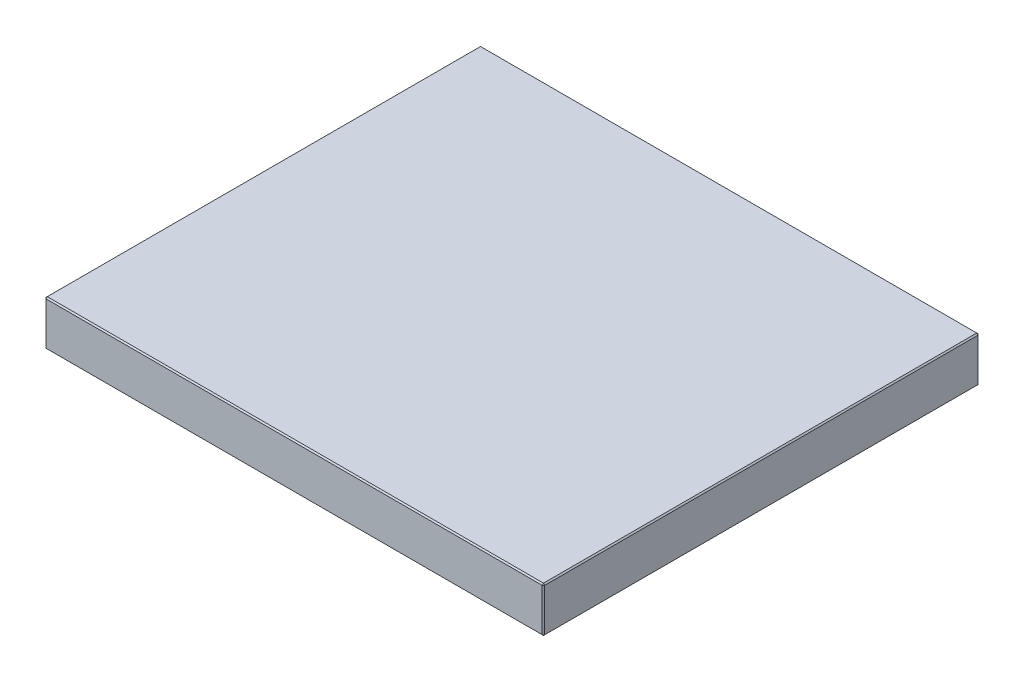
ISO-10303-21;
HEADER;
FILE_DESCRIPTION(('STEP AP214'),'2;1');
FILE_NAME('part.step','',(''),(''),'','','');
FILE_SCHEMA(('AUTOMOTIVE_DESIGN { 1 0 10303 214 1 1 1 1 }'));
ENDSEC;
DATA;
#1=APPLICATION_CONTEXT('core data for automotive mechanical design processes');
#2=APPLICATION_PROTOCOL_DEFINITION('international standard','automotive_design',2000,#1);
#3=PRODUCT_CONTEXT('',#1,'mechanical');
#4=PRODUCT('Part','Part','',(#3));
#5=PRODUCT_RELATED_PRODUCT_CATEGORY('part','',(#4));
#6=PRODUCT_DEFINITION_FORMATION('','',#4);
#7=PRODUCT_DEFINITION_CONTEXT('part definition',#1,'design');
#8=PRODUCT_DEFINITION('design','',#6,#7);
#9=PRODUCT_DEFINITION_SHAPE('','',#8);
#10=(LENGTH_UNIT() NAMED_UNIT(*) SI_UNIT(.MILLI.,.METRE.));
#11=(NAMED_UNIT(*) PLANE_ANGLE_UNIT() SI_UNIT($,.RADIAN.));
#12=(NAMED_UNIT(*) SI_UNIT($,.STERADIAN.) SOLID_ANGLE_UNIT());
#13=UNCERTAINTY_MEASURE_WITH_UNIT(LENGTH_MEASURE(1.E-05),#10,'distance_accuracy_value','');
#14=(GEOMETRIC_REPRESENTATION_CONTEXT(3) GLOBAL_UNCERTAINTY_ASSIGNED_CONTEXT((#13)) GLOBAL_UNIT_ASSIGNED_CONTEXT((#10,
#11,#12)) REPRESENTATION_CONTEXT('',''));
#15=CARTESIAN_POINT('',(0.,0.,0.));
#16=DIRECTION('',(0.,0.,1.));
#17=DIRECTION('',(1.,0.,0.));
#18=AXIS2_PLACEMENT_3D('',#15,#16,#17);
#19=CARTESIAN_POINT('',(-198.,36.,173.));
#20=DIRECTION('',(1.,0.,0.));
#21=DIRECTION('',(0.,0.,-1.));
#22=AXIS2_PLACEMENT_3D('',#19,#20,#21);
#23=PLANE('',#22);
#24=DIRECTION('',(0.,-1.,0.));
#25=VECTOR('',#24,1.);
#26=CARTESIAN_POINT('',(-198.,36.,-172.));
#27=LINE('',#26,#25);
#28=CARTESIAN_POINT('',(-198.,35.,-172.));
#29=VERTEX_POINT('',#28);
#30=CARTESIAN_POINT('',(-198.,1.,-172.));
#31=VERTEX_POINT('',#30);
#32=EDGE_CURVE('E115',#29,#31,#27,.T.);
#33=ORIENTED_EDGE('',*,*,#32,.T.);
#34=DIRECTION('',(0.,0.,1.));
#35=VECTOR('',#34,1.);
#36=CARTESIAN_POINT('',(-198.,1.,173.));
#37=LINE('',#36,#35);
#38=CARTESIAN_POINT('',(-198.,1.,172.));
#39=VERTEX_POINT('',#38);
#40=EDGE_CURVE('E111',#31,#39,#37,.T.);
#41=ORIENTED_EDGE('',*,*,#40,.T.);
#42=DIRECTION('',(0.,1.,0.));
#43=VECTOR('',#42,1.);
#44=CARTESIAN_POINT('',(-198.,36.,172.));
#45=LINE('',#44,#43);
#46=CARTESIAN_POINT('',(-198.,35.,172.));
#47=VERTEX_POINT('',#46);
#48=EDGE_CURVE('E104',#39,#47,#45,.T.);
#49=ORIENTED_EDGE('',*,*,#48,.T.);
#50=DIRECTION('',(0.,0.,-1.));
#51=VECTOR('',#50,1.);
#52=CARTESIAN_POINT('',(-198.,35.,-173.));
#53=LINE('',#52,#51);
#54=EDGE_CURVE('E108',#47,#29,#53,.T.);
#55=ORIENTED_EDGE('',*,*,#54,.T.);
#56=EDGE_LOOP('',(#33,#41,#49,#55));
#57=FACE_BOUND('',#56,.T.);
#58=ADVANCED_FACE('F16',(#57),#23,.F.);
#59=CARTESIAN_POINT('',(198.,36.,173.));
#60=DIRECTION('',(0.,0.,-1.));
#61=DIRECTION('',(-1.,0.,0.));
#62=AXIS2_PLACEMENT_3D('',#59,#60,#61);
#63=PLANE('',#62);
#64=DIRECTION('',(-1.,0.,0.));
#65=VECTOR('',#64,1.);
#66=CARTESIAN_POINT('',(-198.,35.,173.));
#67=LINE('',#66,#65);
#68=CARTESIAN_POINT('',(197.,35.,173.));
#69=VERTEX_POINT('',#68);
#70=CARTESIAN_POINT('',(-197.,35.,173.));
#71=VERTEX_POINT('',#70);
#72=EDGE_CURVE('E165',#69,#71,#67,.T.);
#73=ORIENTED_EDGE('',*,*,#72,.T.);
#74=DIRECTION('',(0.,-1.,0.));
#75=VECTOR('',#74,1.);
#76=CARTESIAN_POINT('',(-197.,36.,173.));
#77=LINE('',#76,#75);
#78=CARTESIAN_POINT('',(-197.,1.00000000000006,173.));
#79=VERTEX_POINT('',#78);
#80=EDGE_CURVE('E123',#71,#79,#77,.T.);
#81=ORIENTED_EDGE('',*,*,#80,.T.);
#82=DIRECTION('',(1.,0.,0.));
#83=VECTOR('',#82,1.);
#84=CARTESIAN_POINT('',(198.,1.00000000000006,173.));
#85=LINE('',#84,#83);
#86=CARTESIAN_POINT('',(197.,1.00000000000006,173.));
#87=VERTEX_POINT('',#86);
#88=EDGE_CURVE('E169',#79,#87,#85,.T.);
#89=ORIENTED_EDGE('',*,*,#88,.T.);
#90=DIRECTION('',(0.,1.,0.));
#91=VECTOR('',#90,1.);
#92=CARTESIAN_POINT('',(197.,36.,173.));
#93=LINE('',#92,#91);
#94=EDGE_CURVE('E167',#87,#69,#93,.T.);
#95=ORIENTED_EDGE('',*,*,#94,.T.);
#96=EDGE_LOOP('',(#73,#81,#89,#95));
#97=FACE_BOUND('',#96,.T.);
#98=ADVANCED_FACE('F276',(#97),#63,.F.);
#99=CARTESIAN_POINT('',(198.,36.,173.));
#100=DIRECTION('',(-1.,0.,0.));
#101=DIRECTION('',(0.,0.,1.));
#102=AXIS2_PLACEMENT_3D('',#99,#100,#101);
#103=PLANE('',#102);
#104=DIRECTION('',(0.,0.,-1.));
#105=VECTOR('',#104,1.);
#106=CARTESIAN_POINT('',(198.,1.00000000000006,173.));
#107=LINE('',#106,#105);
#108=CARTESIAN_POINT('',(198.,1.00000000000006,172.));
#109=VERTEX_POINT('',#108);
#110=CARTESIAN_POINT('',(198.,1.00000000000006,-172.));
#111=VERTEX_POINT('',#110);
#112=EDGE_CURVE('E160',#109,#111,#107,.T.);
#113=ORIENTED_EDGE('',*,*,#112,.T.);
#114=DIRECTION('',(0.,1.,0.));
#115=VECTOR('',#114,1.);
#116=CARTESIAN_POINT('',(198.,36.,-172.));
#117=LINE('',#116,#115);
#118=CARTESIAN_POINT('',(198.,35.,-172.));
#119=VERTEX_POINT('',#118);
#120=EDGE_CURVE('E162',#111,#119,#117,.T.);
#121=ORIENTED_EDGE('',*,*,#120,.T.);
#122=DIRECTION('',(0.,0.,1.));
#123=VECTOR('',#122,1.);
#124=CARTESIAN_POINT('',(198.,35.,173.));
#125=LINE('',#124,#123);
#126=CARTESIAN_POINT('',(198.,35.,172.));
#127=VERTEX_POINT('',#126);
#128=EDGE_CURVE('E156',#119,#127,#125,.T.);
#129=ORIENTED_EDGE('',*,*,#128,.T.);
#130=DIRECTION('',(0.,-1.,0.));
#131=VECTOR('',#130,1.);
#132=CARTESIAN_POINT('',(198.,36.,172.));
#133=LINE('',#132,#131);
#134=EDGE_CURVE('E158',#127,#109,#133,.T.);
#135=ORIENTED_EDGE('',*,*,#134,.T.);
#136=EDGE_LOOP('',(#113,#121,#129,#135));
#137=FACE_BOUND('',#136,.T.);
#138=ADVANCED_FACE('F255',(#137),#103,.F.);
#139=CARTESIAN_POINT('',(198.,36.,-173.));
#140=DIRECTION('',(0.,0.,1.));
#141=DIRECTION('',(1.,0.,0.));
#142=AXIS2_PLACEMENT_3D('',#139,#140,#141);
#143=PLANE('',#142);
#144=DIRECTION('',(0.,-1.,0.));
#145=VECTOR('',#144,1.);
#146=CARTESIAN_POINT('',(197.,36.,-173.));
#147=LINE('',#146,#145);
#148=CARTESIAN_POINT('',(197.,35.,-173.));
#149=VERTEX_POINT('',#148);
#150=CARTESIAN_POINT('',(197.,1.00000000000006,-173.));
#151=VERTEX_POINT('',#150);
#152=EDGE_CURVE('E149',#149,#151,#147,.T.);
#153=ORIENTED_EDGE('',*,*,#152,.T.);
#154=DIRECTION('',(-1.,0.,0.));
#155=VECTOR('',#154,1.);
#156=CARTESIAN_POINT('',(198.,1.00000000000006,-173.));
#157=LINE('',#156,#155);
#158=CARTESIAN_POINT('',(-197.,1.00000000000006,-173.));
#159=VERTEX_POINT('',#158);
#160=EDGE_CURVE('E154',#151,#159,#157,.T.);
#161=ORIENTED_EDGE('',*,*,#160,.T.);
#162=DIRECTION('',(0.,1.,0.));
#163=VECTOR('',#162,1.);
#164=CARTESIAN_POINT('',(-197.,36.,-173.));
#165=LINE('',#164,#163);
#166=CARTESIAN_POINT('',(-197.,35.,-173.));
#167=VERTEX_POINT('',#166);
#168=EDGE_CURVE('E151',#159,#167,#165,.T.);
#169=ORIENTED_EDGE('',*,*,#168,.T.);
#170=DIRECTION('',(1.,0.,0.));
#171=VECTOR('',#170,1.);
#172=CARTESIAN_POINT('',(198.,35.,-173.));
#173=LINE('',#172,#171);
#174=EDGE_CURVE('E147',#167,#149,#173,.T.);
#175=ORIENTED_EDGE('',*,*,#174,.T.);
#176=EDGE_LOOP('',(#153,#161,#169,#175));
#177=FACE_BOUND('',#176,.T.);
#178=ADVANCED_FACE('F285',(#177),#143,.F.);
#179=CARTESIAN_POINT('',(0.,36.,0.));
#180=DIRECTION('',(0.,1.,0.));
#181=DIRECTION('',(0.,0.,1.));
#182=AXIS2_PLACEMENT_3D('',#179,#180,#181);
#183=PLANE('',#182);
#184=DIRECTION('',(0.,0.,-1.));
#185=VECTOR('',#184,1.);
#186=CARTESIAN_POINT('',(197.,36.,-173.));
#187=LINE('',#186,#185);
#188=CARTESIAN_POINT('',(197.,36.,172.));
#189=VERTEX_POINT('',#188);
#190=CARTESIAN_POINT('',(197.,36.,-172.));
#191=VERTEX_POINT('',#190);
#192=EDGE_CURVE('E25',#189,#191,#187,.T.);
#193=ORIENTED_EDGE('',*,*,#192,.T.);
#194=DIRECTION('',(-1.,0.,0.));
#195=VECTOR('',#194,1.);
#196=CARTESIAN_POINT('',(-198.,36.,-172.));
#197=LINE('',#196,#195);
#198=CARTESIAN_POINT('',(-197.,36.,-172.));
#199=VERTEX_POINT('',#198);
#200=EDGE_CURVE('E10',#191,#199,#197,.T.);
#201=ORIENTED_EDGE('',*,*,#200,.T.);
#202=DIRECTION('',(0.,0.,1.));
#203=VECTOR('',#202,1.);
#204=CARTESIAN_POINT('',(-197.,36.,173.));
#205=LINE('',#204,#203);
#206=CARTESIAN_POINT('',(-197.,36.,172.));
#207=VERTEX_POINT('',#206);
#208=EDGE_CURVE('E181',#199,#207,#205,.T.);
#209=ORIENTED_EDGE('',*,*,#208,.T.);
#210=DIRECTION('',(1.,0.,0.));
#211=VECTOR('',#210,1.);
#212=CARTESIAN_POINT('',(198.,36.,172.));
#213=LINE('',#212,#211);
#214=EDGE_CURVE('E36',#207,#189,#213,.T.);
#215=ORIENTED_EDGE('',*,*,#214,.T.);
#216=EDGE_LOOP('',(#193,#201,#209,#215));
#217=FACE_BOUND('',#216,.T.);
#218=ADVANCED_FACE('F351',(#217),#183,.T.);
#219=CARTESIAN_POINT('',(0.,0.,0.));
#220=DIRECTION('',(0.,1.,0.));
#221=DIRECTION('',(0.,0.,1.));
#222=AXIS2_PLACEMENT_3D('',#219,#220,#221);
#223=PLANE('',#222);
#224=DIRECTION('',(0.,0.,1.));
#225=VECTOR('',#224,1.);
#226=CARTESIAN_POINT('',(197.,0.,0.));
#227=LINE('',#226,#225);
#228=CARTESIAN_POINT('',(197.,0.,-172.));
#229=VERTEX_POINT('',#228);
#230=CARTESIAN_POINT('',(197.,0.,172.));
#231=VERTEX_POINT('',#230);
#232=EDGE_CURVE('E172',#229,#231,#227,.T.);
#233=ORIENTED_EDGE('',*,*,#232,.T.);
#234=DIRECTION('',(-1.,0.,0.));
#235=VECTOR('',#234,1.);
#236=CARTESIAN_POINT('',(0.,0.,172.));
#237=LINE('',#236,#235);
#238=CARTESIAN_POINT('',(-197.,0.,172.));
#239=VERTEX_POINT('',#238);
#240=EDGE_CURVE('E178',#231,#239,#237,.T.);
#241=ORIENTED_EDGE('',*,*,#240,.T.);
#242=DIRECTION('',(0.,0.,-1.));
#243=VECTOR('',#242,1.);
#244=CARTESIAN_POINT('',(-197.,0.,0.));
#245=LINE('',#244,#243);
#246=CARTESIAN_POINT('',(-197.,0.,-172.));
#247=VERTEX_POINT('',#246);
#248=EDGE_CURVE('E176',#239,#247,#245,.T.);
#249=ORIENTED_EDGE('',*,*,#248,.T.);
#250=DIRECTION('',(1.,0.,0.));
#251=VECTOR('',#250,1.);
#252=CARTESIAN_POINT('',(0.,0.,-172.));
#253=LINE('',#252,#251);
#254=EDGE_CURVE('E174',#247,#229,#253,.T.);
#255=ORIENTED_EDGE('',*,*,#254,.T.);
#256=EDGE_LOOP('',(#233,#241,#249,#255));
#257=FACE_BOUND('',#256,.T.);
#258=ADVANCED_FACE('F247',(#257),#223,.F.);
#259=CARTESIAN_POINT('',(198.,36.,172.));
#260=DIRECTION('',(-0.707106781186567,0.,-0.707106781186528));
#261=DIRECTION('',(0.,-1.,0.));
#262=AXIS2_PLACEMENT_3D('',#259,#260,#261);
#263=PLANE('',#262);
#264=DIRECTION('',(-0.707106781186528,0.,0.707106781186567));
#265=VECTOR('',#264,1.);
#266=CARTESIAN_POINT('',(197.,35.,173.));
#267=LINE('',#266,#265);
#268=EDGE_CURVE('E20',#69,#127,#267,.F.);
#269=ORIENTED_EDGE('',*,*,#268,.F.);
#270=ORIENTED_EDGE('',*,*,#94,.F.);
#271=DIRECTION('',(0.707106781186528,0.,-0.707106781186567));
#272=VECTOR('',#271,1.);
#273=CARTESIAN_POINT('',(197.,1.00000000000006,173.));
#274=LINE('',#273,#272);
#275=EDGE_CURVE('E143',#109,#87,#274,.F.);
#276=ORIENTED_EDGE('',*,*,#275,.F.);
#277=ORIENTED_EDGE('',*,*,#134,.F.);
#278=EDGE_LOOP('',(#269,#270,#276,#277));
#279=FACE_BOUND('',#278,.T.);
#280=ADVANCED_FACE('F18',(#279),#263,.F.);
#281=CARTESIAN_POINT('',(197.,35.,173.));
#282=DIRECTION('',(0.577350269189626,0.577350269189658,0.577350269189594));
#283=DIRECTION('',(-0.707106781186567,0.707106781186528,0.));
#284=AXIS2_PLACEMENT_3D('',#281,#282,#283);
#285=PLANE('',#284);
#286=DIRECTION('',(0.,-0.707106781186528,0.707106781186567));
#287=VECTOR('',#286,1.);
#288=CARTESIAN_POINT('',(197.,35.,173.));
#289=LINE('',#288,#287);
#290=EDGE_CURVE('E227',#69,#189,#289,.F.);
#291=ORIENTED_EDGE('',*,*,#290,.F.);
#292=ORIENTED_EDGE('',*,*,#268,.T.);
#293=DIRECTION('',(-0.707106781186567,0.707106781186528,0.));
#294=VECTOR('',#293,1.);
#295=CARTESIAN_POINT('',(197.5,35.5,172.));
#296=LINE('',#295,#294);
#297=EDGE_CURVE('E229',#189,#127,#296,.F.);
#298=ORIENTED_EDGE('',*,*,#297,.F.);
#299=EDGE_LOOP('',(#291,#292,#298));
#300=FACE_BOUND('',#299,.T.);
#301=ADVANCED_FACE('F271',(#300),#285,.T.);
#302=CARTESIAN_POINT('',(197.,1.00000000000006,173.));
#303=DIRECTION('',(0.577350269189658,-0.577350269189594,0.577350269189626));
#304=DIRECTION('',(0.707106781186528,0.,-0.707106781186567));
#305=AXIS2_PLACEMENT_3D('',#302,#303,#304);
#306=PLANE('',#305);
#307=DIRECTION('',(-0.707106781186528,-0.707106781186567,0.));
#308=VECTOR('',#307,1.);
#309=CARTESIAN_POINT('',(197.5,0.500000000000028,172.));
#310=LINE('',#309,#308);
#311=EDGE_CURVE('E221',#109,#231,#310,.T.);
#312=ORIENTED_EDGE('',*,*,#311,.F.);
#313=ORIENTED_EDGE('',*,*,#275,.T.);
#314=DIRECTION('',(0.,0.707106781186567,0.707106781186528));
#315=VECTOR('',#314,1.);
#316=CARTESIAN_POINT('',(197.,1.00000000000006,173.));
#317=LINE('',#316,#315);
#318=EDGE_CURVE('E224',#231,#87,#317,.T.);
#319=ORIENTED_EDGE('',*,*,#318,.F.);
#320=EDGE_LOOP('',(#312,#313,#319));
#321=FACE_BOUND('',#320,.T.);
#322=ADVANCED_FACE('F236',(#321),#306,.T.);
#323=CARTESIAN_POINT('',(197.,36.,0.));
#324=DIRECTION('',(0.707106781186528,0.707106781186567,0.));
#325=DIRECTION('',(0.,0.,1.));
#326=AXIS2_PLACEMENT_3D('',#323,#324,#325);
#327=PLANE('',#326);
#328=ORIENTED_EDGE('',*,*,#297,.T.);
#329=ORIENTED_EDGE('',*,*,#128,.F.);
#330=DIRECTION('',(0.707106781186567,-0.707106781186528,0.));
#331=VECTOR('',#330,1.);
#332=CARTESIAN_POINT('',(198.,35.,-172.));
#333=LINE('',#332,#331);
#334=EDGE_CURVE('E216',#191,#119,#333,.T.);
#335=ORIENTED_EDGE('',*,*,#334,.F.);
#336=ORIENTED_EDGE('',*,*,#192,.F.);
#337=EDGE_LOOP('',(#328,#329,#335,#336));
#338=FACE_BOUND('',#337,.T.);
#339=ADVANCED_FACE('F266',(#338),#327,.T.);
#340=CARTESIAN_POINT('',(0.,36.,172.));
#341=DIRECTION('',(0.,0.707106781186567,0.707106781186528));
#342=DIRECTION('',(-1.,0.,0.));
#343=AXIS2_PLACEMENT_3D('',#340,#341,#342);
#344=PLANE('',#343);
#345=ORIENTED_EDGE('',*,*,#290,.T.);
#346=ORIENTED_EDGE('',*,*,#214,.F.);
#347=DIRECTION('',(0.,0.707106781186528,-0.707106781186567));
#348=VECTOR('',#347,1.);
#349=CARTESIAN_POINT('',(-197.,35.5,172.5));
#350=LINE('',#349,#348);
#351=EDGE_CURVE('E127',#71,#207,#350,.T.);
#352=ORIENTED_EDGE('',*,*,#351,.F.);
#353=ORIENTED_EDGE('',*,*,#72,.F.);
#354=EDGE_LOOP('',(#345,#346,#352,#353));
#355=FACE_BOUND('',#354,.T.);
#356=ADVANCED_FACE('F274',(#355),#344,.T.);
#357=CARTESIAN_POINT('',(-197.,36.,173.));
#358=DIRECTION('',(0.707106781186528,0.,-0.707106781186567));
#359=DIRECTION('',(0.,-1.,0.));
#360=AXIS2_PLACEMENT_3D('',#357,#358,#359);
#361=PLANE('',#360);
#362=DIRECTION('',(0.707106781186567,0.,0.707106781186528));
#363=VECTOR('',#362,1.);
#364=CARTESIAN_POINT('',(-197.,1.00000000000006,173.));
#365=LINE('',#364,#363);
#366=EDGE_CURVE('E128',#79,#39,#365,.F.);
#367=ORIENTED_EDGE('',*,*,#366,.F.);
#368=ORIENTED_EDGE('',*,*,#80,.F.);
#369=DIRECTION('',(-0.707106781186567,0.,-0.707106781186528));
#370=VECTOR('',#369,1.);
#371=CARTESIAN_POINT('',(-198.,35.,172.));
#372=LINE('',#371,#370);
#373=EDGE_CURVE('E119',#47,#71,#372,.F.);
#374=ORIENTED_EDGE('',*,*,#373,.F.);
#375=ORIENTED_EDGE('',*,*,#48,.F.);
#376=EDGE_LOOP('',(#367,#368,#374,#375));
#377=FACE_BOUND('',#376,.T.);
#378=ADVANCED_FACE('F121',(#377),#361,.F.);
#379=CARTESIAN_POINT('',(198.,1.00000000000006,173.));
#380=DIRECTION('',(0.,0.707106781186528,-0.707106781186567));
#381=DIRECTION('',(1.,0.,0.));
#382=AXIS2_PLACEMENT_3D('',#379,#380,#381);
#383=PLANE('',#382);
#384=ORIENTED_EDGE('',*,*,#318,.T.);
#385=ORIENTED_EDGE('',*,*,#88,.F.);
#386=DIRECTION('',(0.,-0.707106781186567,-0.707106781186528));
#387=VECTOR('',#386,1.);
#388=CARTESIAN_POINT('',(-197.,1.00000000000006,173.));
#389=LINE('',#388,#387);
#390=EDGE_CURVE('E212',#239,#79,#389,.F.);
#391=ORIENTED_EDGE('',*,*,#390,.F.);
#392=ORIENTED_EDGE('',*,*,#240,.F.);
#393=EDGE_LOOP('',(#384,#385,#391,#392));
#394=FACE_BOUND('',#393,.T.);
#395=ADVANCED_FACE('F244',(#394),#383,.F.);
#396=CARTESIAN_POINT('',(198.,1.00000000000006,173.));
#397=DIRECTION('',(-0.707106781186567,0.707106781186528,0.));
#398=DIRECTION('',(0.,0.,-1.));
#399=AXIS2_PLACEMENT_3D('',#396,#397,#398);
#400=PLANE('',#399);
#401=ORIENTED_EDGE('',*,*,#311,.T.);
#402=ORIENTED_EDGE('',*,*,#232,.F.);
#403=DIRECTION('',(0.707106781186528,0.707106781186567,0.));
#404=VECTOR('',#403,1.);
#405=CARTESIAN_POINT('',(197.5,0.500000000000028,-172.));
#406=LINE('',#405,#404);
#407=EDGE_CURVE('E209',#111,#229,#406,.F.);
#408=ORIENTED_EDGE('',*,*,#407,.F.);
#409=ORIENTED_EDGE('',*,*,#112,.F.);
#410=EDGE_LOOP('',(#401,#402,#408,#409));
#411=FACE_BOUND('',#410,.T.);
#412=ADVANCED_FACE('F252',(#411),#400,.F.);
#413=CARTESIAN_POINT('',(197.,36.,-173.));
#414=DIRECTION('',(-0.707106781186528,0.,0.707106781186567));
#415=DIRECTION('',(0.,-1.,0.));
#416=AXIS2_PLACEMENT_3D('',#413,#414,#415);
#417=PLANE('',#416);
#418=DIRECTION('',(0.707106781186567,0.,0.707106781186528));
#419=VECTOR('',#418,1.);
#420=CARTESIAN_POINT('',(198.,35.,-172.));
#421=LINE('',#420,#419);
#422=EDGE_CURVE('E218',#119,#149,#421,.F.);
#423=ORIENTED_EDGE('',*,*,#422,.F.);
#424=ORIENTED_EDGE('',*,*,#120,.F.);
#425=DIRECTION('',(-0.707106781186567,0.,-0.707106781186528));
#426=VECTOR('',#425,1.);
#427=CARTESIAN_POINT('',(197.,1.00000000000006,-173.));
#428=LINE('',#427,#426);
#429=EDGE_CURVE('E206',#151,#111,#428,.F.);
#430=ORIENTED_EDGE('',*,*,#429,.F.);
#431=ORIENTED_EDGE('',*,*,#152,.F.);
#432=EDGE_LOOP('',(#423,#424,#430,#431));
#433=FACE_BOUND('',#432,.T.);
#434=ADVANCED_FACE('F259',(#433),#417,.F.);
#435=CARTESIAN_POINT('',(198.,35.,-172.));
#436=DIRECTION('',(0.577350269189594,0.577350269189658,-0.577350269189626));
#437=DIRECTION('',(0.,0.707106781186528,0.707106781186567));
#438=AXIS2_PLACEMENT_3D('',#435,#436,#437);
#439=PLANE('',#438);
#440=ORIENTED_EDGE('',*,*,#334,.T.);
#441=ORIENTED_EDGE('',*,*,#422,.T.);
#442=DIRECTION('',(0.,0.707106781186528,0.707106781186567));
#443=VECTOR('',#442,1.);
#444=CARTESIAN_POINT('',(197.,35.5,-172.5));
#445=LINE('',#444,#443);
#446=EDGE_CURVE('E135',#191,#149,#445,.F.);
#447=ORIENTED_EDGE('',*,*,#446,.F.);
#448=EDGE_LOOP('',(#440,#441,#447));
#449=FACE_BOUND('',#448,.T.);
#450=ADVANCED_FACE('F326',(#449),#439,.T.);
#451=CARTESIAN_POINT('',(-198.,35.,172.));
#452=DIRECTION('',(-0.577350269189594,0.577350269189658,0.577350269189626));
#453=DIRECTION('',(0.,-0.707106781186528,0.707106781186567));
#454=AXIS2_PLACEMENT_3D('',#451,#452,#453);
#455=PLANE('',#454);
#456=ORIENTED_EDGE('',*,*,#373,.T.);
#457=ORIENTED_EDGE('',*,*,#351,.T.);
#458=DIRECTION('',(-0.707106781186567,-0.707106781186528,0.));
#459=VECTOR('',#458,1.);
#460=CARTESIAN_POINT('',(-198.,35.,172.));
#461=LINE('',#460,#459);
#462=EDGE_CURVE('E131',#47,#207,#461,.F.);
#463=ORIENTED_EDGE('',*,*,#462,.F.);
#464=EDGE_LOOP('',(#456,#457,#463));
#465=FACE_BOUND('',#464,.T.);
#466=ADVANCED_FACE('F132',(#465),#455,.T.);
#467=CARTESIAN_POINT('',(-197.,1.00000000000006,173.));
#468=DIRECTION('',(-0.577350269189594,-0.577350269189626,0.577350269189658));
#469=DIRECTION('',(0.,-0.707106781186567,-0.707106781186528));
#470=AXIS2_PLACEMENT_3D('',#467,#468,#469);
#471=PLANE('',#470);
#472=ORIENTED_EDGE('',*,*,#390,.T.);
#473=ORIENTED_EDGE('',*,*,#366,.T.);
#474=DIRECTION('',(-0.707106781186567,0.707106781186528,0.));
#475=VECTOR('',#474,1.);
#476=CARTESIAN_POINT('',(-197.5,0.5,172.));
#477=LINE('',#476,#475);
#478=EDGE_CURVE('E136',#239,#39,#477,.T.);
#479=ORIENTED_EDGE('',*,*,#478,.F.);
#480=EDGE_LOOP('',(#472,#473,#479));
#481=FACE_BOUND('',#480,.T.);
#482=ADVANCED_FACE('F319',(#481),#471,.T.);
#483=CARTESIAN_POINT('',(197.,1.00000000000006,-173.));
#484=DIRECTION('',(0.577350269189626,-0.577350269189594,-0.577350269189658));
#485=DIRECTION('',(-0.707106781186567,0.,-0.707106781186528));
#486=AXIS2_PLACEMENT_3D('',#483,#484,#485);
#487=PLANE('',#486);
#488=ORIENTED_EDGE('',*,*,#429,.T.);
#489=ORIENTED_EDGE('',*,*,#407,.T.);
#490=DIRECTION('',(0.,-0.707106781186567,0.707106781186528));
#491=VECTOR('',#490,1.);
#492=CARTESIAN_POINT('',(197.,1.00000000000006,-173.));
#493=LINE('',#492,#491);
#494=EDGE_CURVE('E199',#151,#229,#493,.T.);
#495=ORIENTED_EDGE('',*,*,#494,.F.);
#496=EDGE_LOOP('',(#488,#489,#495));
#497=FACE_BOUND('',#496,.T.);
#498=ADVANCED_FACE('F315',(#497),#487,.T.);
#499=CARTESIAN_POINT('',(0.,36.,-172.));
#500=DIRECTION('',(0.,0.707106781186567,-0.707106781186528));
#501=DIRECTION('',(1.,0.,0.));
#502=AXIS2_PLACEMENT_3D('',#499,#500,#501);
#503=PLANE('',#502);
#504=ORIENTED_EDGE('',*,*,#446,.T.);
#505=ORIENTED_EDGE('',*,*,#174,.F.);
#506=DIRECTION('',(0.,-0.707106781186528,-0.707106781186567));
#507=VECTOR('',#506,1.);
#508=CARTESIAN_POINT('',(-197.,35.,-173.));
#509=LINE('',#508,#507);
#510=EDGE_CURVE('E196',#199,#167,#509,.T.);
#511=ORIENTED_EDGE('',*,*,#510,.F.);
#512=ORIENTED_EDGE('',*,*,#200,.F.);
#513=EDGE_LOOP('',(#504,#505,#511,#512));
#514=FACE_BOUND('',#513,.T.);
#515=ADVANCED_FACE('F312',(#514),#503,.T.);
#516=CARTESIAN_POINT('',(-197.,36.,0.));
#517=DIRECTION('',(-0.707106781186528,0.707106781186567,0.));
#518=DIRECTION('',(0.,0.,-1.));
#519=AXIS2_PLACEMENT_3D('',#516,#517,#518);
#520=PLANE('',#519);
#521=ORIENTED_EDGE('',*,*,#462,.T.);
#522=ORIENTED_EDGE('',*,*,#208,.F.);
#523=DIRECTION('',(0.707106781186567,0.707106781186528,0.));
#524=VECTOR('',#523,1.);
#525=CARTESIAN_POINT('',(-197.5,35.5,-172.));
#526=LINE('',#525,#524);
#527=EDGE_CURVE('E139',#29,#199,#526,.T.);
#528=ORIENTED_EDGE('',*,*,#527,.F.);
#529=ORIENTED_EDGE('',*,*,#54,.F.);
#530=EDGE_LOOP('',(#521,#522,#528,#529));
#531=FACE_BOUND('',#530,.T.);
#532=ADVANCED_FACE('F138',(#531),#520,.T.);
#533=CARTESIAN_POINT('',(-198.,1.,173.));
#534=DIRECTION('',(0.707106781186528,0.707106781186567,0.));
#535=DIRECTION('',(0.,0.,1.));
#536=AXIS2_PLACEMENT_3D('',#533,#534,#535);
#537=PLANE('',#536);
#538=ORIENTED_EDGE('',*,*,#478,.T.);
#539=ORIENTED_EDGE('',*,*,#40,.F.);
#540=DIRECTION('',(0.707106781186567,-0.707106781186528,0.));
#541=VECTOR('',#540,1.);
#542=CARTESIAN_POINT('',(-198.,1.,-172.));
#543=LINE('',#542,#541);
#544=EDGE_CURVE('E192',#247,#31,#543,.F.);
#545=ORIENTED_EDGE('',*,*,#544,.F.);
#546=ORIENTED_EDGE('',*,*,#248,.F.);
#547=EDGE_LOOP('',(#538,#539,#545,#546));
#548=FACE_BOUND('',#547,.T.);
#549=ADVANCED_FACE('F305',(#548),#537,.F.);
#550=CARTESIAN_POINT('',(198.,1.00000000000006,-173.));
#551=DIRECTION('',(0.,0.707106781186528,0.707106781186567));
#552=DIRECTION('',(-1.,0.,0.));
#553=AXIS2_PLACEMENT_3D('',#550,#551,#552);
#554=PLANE('',#553);
#555=ORIENTED_EDGE('',*,*,#494,.T.);
#556=ORIENTED_EDGE('',*,*,#254,.F.);
#557=DIRECTION('',(0.,0.707106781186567,-0.707106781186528));
#558=VECTOR('',#557,1.);
#559=CARTESIAN_POINT('',(-197.,0.500000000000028,-172.5));
#560=LINE('',#559,#558);
#561=EDGE_CURVE('E189',#159,#247,#560,.F.);
#562=ORIENTED_EDGE('',*,*,#561,.F.);
#563=ORIENTED_EDGE('',*,*,#160,.F.);
#564=EDGE_LOOP('',(#555,#556,#562,#563));
#565=FACE_BOUND('',#564,.T.);
#566=ADVANCED_FACE('F301',(#565),#554,.F.);
#567=CARTESIAN_POINT('',(-197.,35.,-173.));
#568=DIRECTION('',(-0.577350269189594,0.577350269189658,-0.577350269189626));
#569=DIRECTION('',(0.,0.707106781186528,0.707106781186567));
#570=AXIS2_PLACEMENT_3D('',#567,#568,#569);
#571=PLANE('',#570);
#572=ORIENTED_EDGE('',*,*,#527,.T.);
#573=ORIENTED_EDGE('',*,*,#510,.T.);
#574=DIRECTION('',(0.707106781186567,0.,-0.707106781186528));
#575=VECTOR('',#574,1.);
#576=CARTESIAN_POINT('',(-197.,35.,-173.));
#577=LINE('',#576,#575);
#578=EDGE_CURVE('E187',#29,#167,#577,.T.);
#579=ORIENTED_EDGE('',*,*,#578,.F.);
#580=EDGE_LOOP('',(#572,#573,#579));
#581=FACE_BOUND('',#580,.T.);
#582=ADVANCED_FACE('F297',(#581),#571,.T.);
#583=CARTESIAN_POINT('',(-198.,1.,-172.));
#584=DIRECTION('',(-0.577350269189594,-0.577350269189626,-0.577350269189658));
#585=DIRECTION('',(0.,0.707106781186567,-0.707106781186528));
#586=AXIS2_PLACEMENT_3D('',#583,#584,#585);
#587=PLANE('',#586);
#588=ORIENTED_EDGE('',*,*,#561,.T.);
#589=ORIENTED_EDGE('',*,*,#544,.T.);
#590=DIRECTION('',(-0.707106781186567,0.,0.707106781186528));
#591=VECTOR('',#590,1.);
#592=CARTESIAN_POINT('',(-198.,1.,-172.));
#593=LINE('',#592,#591);
#594=EDGE_CURVE('E185',#159,#31,#593,.T.);
#595=ORIENTED_EDGE('',*,*,#594,.F.);
#596=EDGE_LOOP('',(#588,#589,#595));
#597=FACE_BOUND('',#596,.T.);
#598=ADVANCED_FACE('F293',(#597),#587,.T.);
#599=CARTESIAN_POINT('',(-198.,36.,-172.));
#600=DIRECTION('',(0.707106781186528,0.,0.707106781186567));
#601=DIRECTION('',(0.,-1.,0.));
#602=AXIS2_PLACEMENT_3D('',#599,#600,#601);
#603=PLANE('',#602);
#604=ORIENTED_EDGE('',*,*,#578,.T.);
#605=ORIENTED_EDGE('',*,*,#168,.F.);
#606=ORIENTED_EDGE('',*,*,#594,.T.);
#607=ORIENTED_EDGE('',*,*,#32,.F.);
#608=EDGE_LOOP('',(#604,#605,#606,#607));
#609=FACE_BOUND('',#608,.T.);
#610=ADVANCED_FACE('F290',(#609),#603,.F.);
#611=CLOSED_SHELL('',(#58,#98,#138,#178,#218,#258,#280,#301,#322,#339,#356,#378,#395,#412,#434,
#450,#466,#482,#498,#515,#532,#549,#566,#582,#598,#610));
#612=MANIFOLD_SOLID_BREP('B1',#611);
#613=ADVANCED_BREP_SHAPE_REPRESENTATION('',(#18,#612),#14);
#614=SHAPE_DEFINITION_REPRESENTATION(#9,#613);
ENDSEC;
END-ISO-10303-21;
